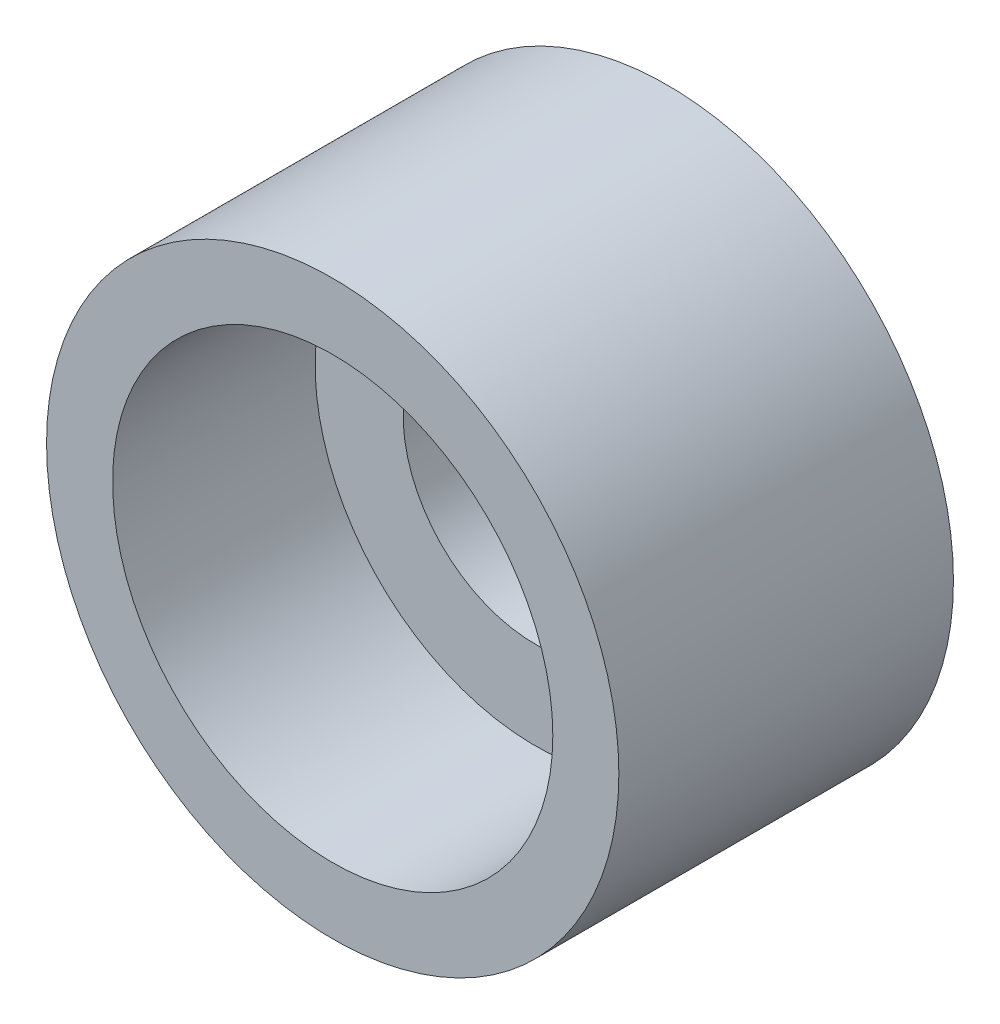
ISO-10303-21;
HEADER;
FILE_DESCRIPTION(('STEP AP214'),'2;1');
FILE_NAME('part.step','',(''),(''),'','','');
FILE_SCHEMA(('AUTOMOTIVE_DESIGN { 1 0 10303 214 1 1 1 1 }'));
ENDSEC;
DATA;
#1=APPLICATION_CONTEXT('core data for automotive mechanical design processes');
#2=APPLICATION_PROTOCOL_DEFINITION('international standard','automotive_design',2000,#1);
#3=PRODUCT_CONTEXT('',#1,'mechanical');
#4=PRODUCT('Part','Part','',(#3));
#5=PRODUCT_RELATED_PRODUCT_CATEGORY('part','',(#4));
#6=PRODUCT_DEFINITION_FORMATION('','',#4);
#7=PRODUCT_DEFINITION_CONTEXT('part definition',#1,'design');
#8=PRODUCT_DEFINITION('design','',#6,#7);
#9=PRODUCT_DEFINITION_SHAPE('','',#8);
#10=(LENGTH_UNIT() NAMED_UNIT(*) SI_UNIT(.MILLI.,.METRE.));
#11=(NAMED_UNIT(*) PLANE_ANGLE_UNIT() SI_UNIT($,.RADIAN.));
#12=(NAMED_UNIT(*) SI_UNIT($,.STERADIAN.) SOLID_ANGLE_UNIT());
#13=UNCERTAINTY_MEASURE_WITH_UNIT(LENGTH_MEASURE(1.E-05),#10,'distance_accuracy_value','');
#14=(GEOMETRIC_REPRESENTATION_CONTEXT(3) GLOBAL_UNCERTAINTY_ASSIGNED_CONTEXT((#13)) GLOBAL_UNIT_ASSIGNED_CONTEXT((#10,
#11,#12)) REPRESENTATION_CONTEXT('',''));
#15=CARTESIAN_POINT('',(0.,0.,0.));
#16=DIRECTION('',(0.,0.,1.));
#17=DIRECTION('',(1.,0.,0.));
#18=AXIS2_PLACEMENT_3D('',#15,#16,#17);
#19=CARTESIAN_POINT('',(0.,0.,3.));
#20=DIRECTION('',(0.,0.,1.));
#21=DIRECTION('',(1.00000000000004,0.,0.));
#22=AXIS2_PLACEMENT_3D('',#19,#20,#21);
#23=PLANE('',#22);
#24=CARTESIAN_POINT('',(0.,0.,3.));
#25=DIRECTION('',(0.,0.,1.));
#26=DIRECTION('',(1.00000000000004,0.,0.));
#27=AXIS2_PLACEMENT_3D('',#24,#25,#26);
#28=CIRCLE('',#27,10.);
#29=CARTESIAN_POINT('',(10.0000000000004,0.,3.));
#30=VERTEX_POINT('',#29);
#31=EDGE_CURVE('E12',#30,#30,#28,.F.);
#32=ORIENTED_EDGE('',*,*,#31,.F.);
#33=EDGE_LOOP('',(#32));
#34=FACE_BOUND('',#33,.T.);
#35=CARTESIAN_POINT('',(0.,0.,3.));
#36=DIRECTION('',(0.,0.,1.));
#37=DIRECTION('',(1.00000000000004,0.,0.));
#38=AXIS2_PLACEMENT_3D('',#35,#36,#37);
#39=CIRCLE('',#38,6.);
#40=CARTESIAN_POINT('',(6.00000000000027,0.,3.));
#41=VERTEX_POINT('',#40);
#42=EDGE_CURVE('E49',#41,#41,#39,.T.);
#43=ORIENTED_EDGE('',*,*,#42,.F.);
#44=EDGE_LOOP('',(#43));
#45=FACE_BOUND('',#44,.T.);
#46=ADVANCED_FACE('F38',(#34,#45),#23,.T.);
#47=CARTESIAN_POINT('',(0.,0.,-3.));
#48=DIRECTION('',(0.,0.,1.));
#49=DIRECTION('',(1.00000000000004,0.,0.));
#50=AXIS2_PLACEMENT_3D('',#47,#48,#49);
#51=PLANE('',#50);
#52=CARTESIAN_POINT('',(0.,0.,-3.));
#53=DIRECTION('',(0.,0.,1.));
#54=DIRECTION('',(1.00000000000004,0.,0.));
#55=AXIS2_PLACEMENT_3D('',#52,#53,#54);
#56=CIRCLE('',#55,13.);
#57=CARTESIAN_POINT('',(13.0000000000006,0.,-2.99999999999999));
#58=VERTEX_POINT('',#57);
#59=EDGE_CURVE('E45',#58,#58,#56,.T.);
#60=ORIENTED_EDGE('',*,*,#59,.F.);
#61=EDGE_LOOP('',(#60));
#62=FACE_BOUND('',#61,.T.);
#63=CARTESIAN_POINT('',(0.,0.,-3.));
#64=DIRECTION('',(0.,0.,1.));
#65=DIRECTION('',(1.00000000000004,0.,0.));
#66=AXIS2_PLACEMENT_3D('',#63,#64,#65);
#67=CIRCLE('',#66,6.);
#68=CARTESIAN_POINT('',(6.00000000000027,0.,-2.99999999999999));
#69=VERTEX_POINT('',#68);
#70=EDGE_CURVE('E53',#69,#69,#67,.T.);
#71=ORIENTED_EDGE('',*,*,#70,.T.);
#72=EDGE_LOOP('',(#71));
#73=FACE_BOUND('',#72,.T.);
#74=ADVANCED_FACE('F81',(#62,#73),#51,.F.);
#75=CARTESIAN_POINT('',(0.,0.,3.));
#76=DIRECTION('',(0.,0.,-1.));
#77=DIRECTION('',(-1.00000000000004,0.,0.));
#78=AXIS2_PLACEMENT_3D('',#75,#76,#77);
#79=CYLINDRICAL_SURFACE('',#78,13.);
#80=ORIENTED_EDGE('',*,*,#59,.T.);
#81=EDGE_LOOP('',(#80));
#82=FACE_BOUND('',#81,.T.);
#83=CARTESIAN_POINT('',(0.,0.,12.2));
#84=DIRECTION('',(0.,0.,1.));
#85=DIRECTION('',(1.00000000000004,0.,0.));
#86=AXIS2_PLACEMENT_3D('',#83,#84,#85);
#87=CIRCLE('',#86,13.);
#88=CARTESIAN_POINT('',(13.0000000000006,0.,12.2));
#89=VERTEX_POINT('',#88);
#90=EDGE_CURVE('E58',#89,#89,#87,.T.);
#91=ORIENTED_EDGE('',*,*,#90,.F.);
#92=EDGE_LOOP('',(#91));
#93=FACE_BOUND('',#92,.T.);
#94=ADVANCED_FACE('F40',(#82,#93),#79,.T.);
#95=CARTESIAN_POINT('',(0.,0.,3.));
#96=DIRECTION('',(0.,0.,-1.));
#97=DIRECTION('',(-1.00000000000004,0.,0.));
#98=AXIS2_PLACEMENT_3D('',#95,#96,#97);
#99=CYLINDRICAL_SURFACE('',#98,6.);
#100=ORIENTED_EDGE('',*,*,#42,.T.);
#101=EDGE_LOOP('',(#100));
#102=FACE_BOUND('',#101,.T.);
#103=ORIENTED_EDGE('',*,*,#70,.F.);
#104=EDGE_LOOP('',(#103));
#105=FACE_BOUND('',#104,.T.);
#106=ADVANCED_FACE('F69',(#102,#105),#99,.F.);
#107=CARTESIAN_POINT('',(0.,0.,12.2));
#108=DIRECTION('',(0.,0.,1.));
#109=DIRECTION('',(1.00000000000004,0.,0.));
#110=AXIS2_PLACEMENT_3D('',#107,#108,#109);
#111=PLANE('',#110);
#112=ORIENTED_EDGE('',*,*,#90,.T.);
#113=EDGE_LOOP('',(#112));
#114=FACE_BOUND('',#113,.T.);
#115=CARTESIAN_POINT('',(0.,0.,12.2));
#116=DIRECTION('',(0.,0.,1.));
#117=DIRECTION('',(1.00000000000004,0.,0.));
#118=AXIS2_PLACEMENT_3D('',#115,#116,#117);
#119=CIRCLE('',#118,10.);
#120=CARTESIAN_POINT('',(10.0000000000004,0.,12.2));
#121=VERTEX_POINT('',#120);
#122=EDGE_CURVE('E61',#121,#121,#119,.T.);
#123=ORIENTED_EDGE('',*,*,#122,.F.);
#124=EDGE_LOOP('',(#123));
#125=FACE_BOUND('',#124,.T.);
#126=ADVANCED_FACE('F67',(#114,#125),#111,.T.);
#127=CARTESIAN_POINT('',(0.,0.,12.2));
#128=DIRECTION('',(0.,0.,-1.));
#129=DIRECTION('',(-1.00000000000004,0.,0.));
#130=AXIS2_PLACEMENT_3D('',#127,#128,#129);
#131=CYLINDRICAL_SURFACE('',#130,10.);
#132=ORIENTED_EDGE('',*,*,#122,.T.);
#133=EDGE_LOOP('',(#132));
#134=FACE_BOUND('',#133,.T.);
#135=ORIENTED_EDGE('',*,*,#31,.T.);
#136=EDGE_LOOP('',(#135));
#137=FACE_BOUND('',#136,.T.);
#138=ADVANCED_FACE('F65',(#134,#137),#131,.F.);
#139=CLOSED_SHELL('',(#46,#74,#94,#106,#126,#138));
#140=MANIFOLD_SOLID_BREP('B2',#139);
#141=ADVANCED_BREP_SHAPE_REPRESENTATION('',(#18,#140),#14);
#142=SHAPE_DEFINITION_REPRESENTATION(#9,#141);
ENDSEC;
END-ISO-10303-21;
